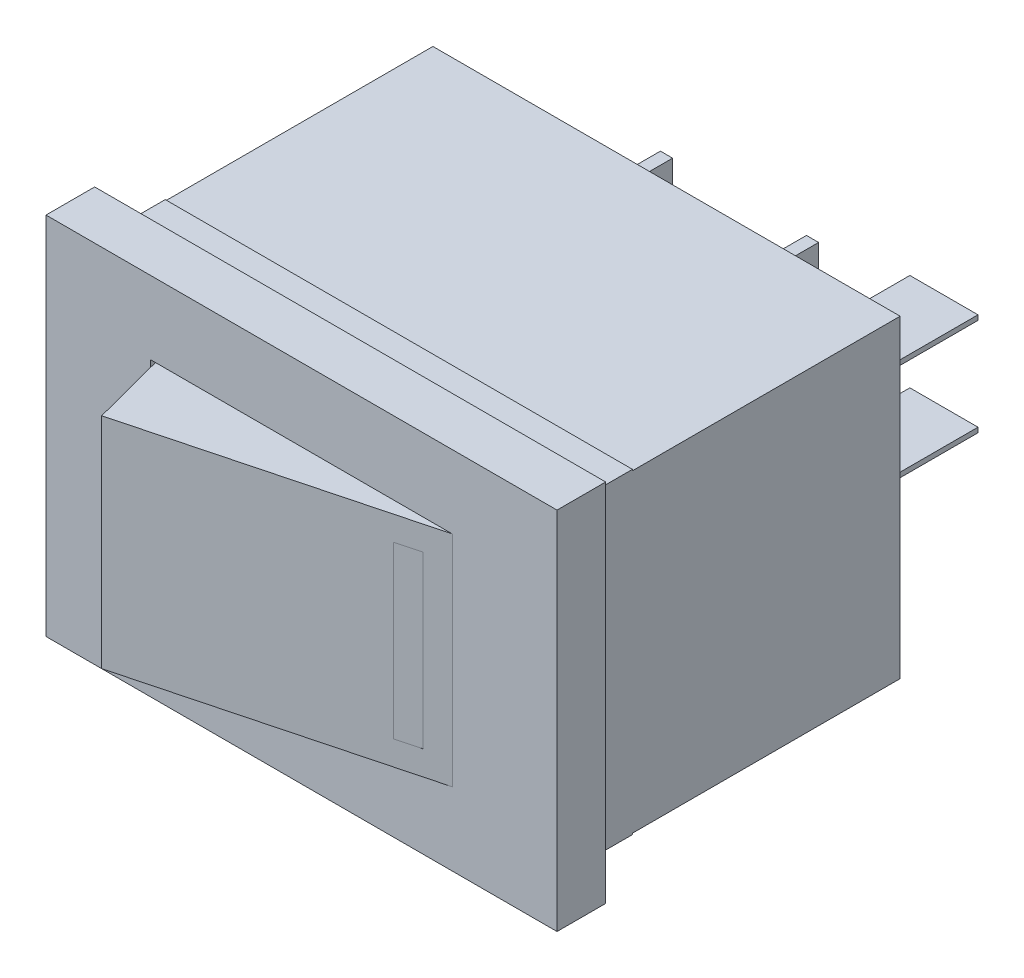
ISO-10303-21;
HEADER;
FILE_DESCRIPTION(('STEP AP214'),'2;1');
FILE_NAME('part.step','',(''),(''),'','','');
FILE_SCHEMA(('AUTOMOTIVE_DESIGN { 1 0 10303 214 1 1 1 1 }'));
ENDSEC;
DATA;
#1=APPLICATION_CONTEXT('core data for automotive mechanical design processes');
#2=APPLICATION_PROTOCOL_DEFINITION('international standard','automotive_design',2000,#1);
#3=PRODUCT_CONTEXT('',#1,'mechanical');
#4=PRODUCT('Part','Part','',(#3));
#5=PRODUCT_RELATED_PRODUCT_CATEGORY('part','',(#4));
#6=PRODUCT_DEFINITION_FORMATION('','',#4);
#7=PRODUCT_DEFINITION_CONTEXT('part definition',#1,'design');
#8=PRODUCT_DEFINITION('design','',#6,#7);
#9=PRODUCT_DEFINITION_SHAPE('','',#8);
#10=(LENGTH_UNIT() NAMED_UNIT(*) SI_UNIT(.MILLI.,.METRE.));
#11=(NAMED_UNIT(*) PLANE_ANGLE_UNIT() SI_UNIT($,.RADIAN.));
#12=(NAMED_UNIT(*) SI_UNIT($,.STERADIAN.) SOLID_ANGLE_UNIT());
#13=UNCERTAINTY_MEASURE_WITH_UNIT(LENGTH_MEASURE(1.E-05),#10,'distance_accuracy_value','');
#14=(GEOMETRIC_REPRESENTATION_CONTEXT(3) GLOBAL_UNCERTAINTY_ASSIGNED_CONTEXT((#13)) GLOBAL_UNIT_ASSIGNED_CONTEXT((#10,
#11,#12)) REPRESENTATION_CONTEXT('',''));
#15=CARTESIAN_POINT('',(0.,0.,0.));
#16=DIRECTION('',(0.,0.,1.));
#17=DIRECTION('',(1.,0.,0.));
#18=AXIS2_PLACEMENT_3D('',#15,#16,#17);
#19=CARTESIAN_POINT('',(-24.6930619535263,4.5,1.28990063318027));
#20=DIRECTION('',(0.,1.,0.));
#21=DIRECTION('',(0.,0.,1.));
#22=AXIS2_PLACEMENT_3D('',#19,#20,#21);
#23=PLANE('',#22);
#24=DIRECTION('',(0.254120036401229,0.,0.967172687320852));
#25=VECTOR('',#24,1.);
#26=CARTESIAN_POINT('',(5.03897727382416,4.5,-2.41881516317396));
#27=LINE('',#26,#25);
#28=CARTESIAN_POINT('',(5.03897727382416,4.5,-2.41881516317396));
#29=VERTEX_POINT('',#28);
#30=CARTESIAN_POINT('',(6.2,4.5,2.));
#31=VERTEX_POINT('',#30);
#32=EDGE_CURVE('E13',#29,#31,#27,.T.);
#33=ORIENTED_EDGE('',*,*,#32,.F.);
#34=DIRECTION('',(0.967172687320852,0.,-0.254120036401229));
#35=VECTOR('',#34,1.);
#36=CARTESIAN_POINT('',(-6.3736604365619,4.5,0.579801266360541));
#37=LINE('',#36,#35);
#38=CARTESIAN_POINT('',(-6.3736604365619,4.5,0.579801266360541));
#39=VERTEX_POINT('',#38);
#40=EDGE_CURVE('E71',#39,#29,#37,.T.);
#41=ORIENTED_EDGE('',*,*,#40,.F.);
#42=DIRECTION('',(-0.254120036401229,0.,-0.967172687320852));
#43=VECTOR('',#42,1.);
#44=CARTESIAN_POINT('',(-5.21263771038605,4.5,4.99861642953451));
#45=LINE('',#44,#43);
#46=CARTESIAN_POINT('',(-5.21263771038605,4.5,4.99861642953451));
#47=VERTEX_POINT('',#46);
#48=EDGE_CURVE('E172',#47,#39,#45,.T.);
#49=ORIENTED_EDGE('',*,*,#48,.F.);
#50=DIRECTION('',(-0.967172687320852,0.,0.254120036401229));
#51=VECTOR('',#50,1.);
#52=CARTESIAN_POINT('',(6.2,4.5,2.));
#53=LINE('',#52,#51);
#54=EDGE_CURVE('E178',#31,#47,#53,.T.);
#55=ORIENTED_EDGE('',*,*,#54,.F.);
#56=EDGE_LOOP('',(#33,#41,#49,#55));
#57=FACE_BOUND('',#56,.T.);
#58=ADVANCED_FACE('F46',(#57),#23,.T.);
#59=CARTESIAN_POINT('',(-6.3736604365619,0.,0.579801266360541));
#60=DIRECTION('',(0.254120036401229,0.,0.967172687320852));
#61=DIRECTION('',(0.967172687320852,0.,-0.254120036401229));
#62=AXIS2_PLACEMENT_3D('',#59,#60,#61);
#63=PLANE('',#62);
#64=ORIENTED_EDGE('',*,*,#40,.T.);
#65=DIRECTION('',(0.,1.,0.));
#66=VECTOR('',#65,1.);
#67=CARTESIAN_POINT('',(5.03897727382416,0.,-2.41881516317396));
#68=LINE('',#67,#66);
#69=CARTESIAN_POINT('',(5.03897727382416,-4.5,-2.41881516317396));
#70=VERTEX_POINT('',#69);
#71=EDGE_CURVE('E170',#70,#29,#68,.T.);
#72=ORIENTED_EDGE('',*,*,#71,.F.);
#73=DIRECTION('',(0.967172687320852,0.,-0.254120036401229));
#74=VECTOR('',#73,1.);
#75=CARTESIAN_POINT('',(-6.3736604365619,-4.5,0.579801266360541));
#76=LINE('',#75,#74);
#77=CARTESIAN_POINT('',(-6.3736604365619,-4.5,0.579801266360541));
#78=VERTEX_POINT('',#77);
#79=EDGE_CURVE('E147',#78,#70,#76,.T.);
#80=ORIENTED_EDGE('',*,*,#79,.F.);
#81=DIRECTION('',(0.,1.,0.));
#82=VECTOR('',#81,1.);
#83=CARTESIAN_POINT('',(-6.3736604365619,0.,0.579801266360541));
#84=LINE('',#83,#82);
#85=EDGE_CURVE('E173',#78,#39,#84,.T.);
#86=ORIENTED_EDGE('',*,*,#85,.T.);
#87=EDGE_LOOP('',(#64,#72,#80,#86));
#88=FACE_BOUND('',#87,.T.);
#89=ADVANCED_FACE('F197',(#88),#63,.F.);
#90=CARTESIAN_POINT('',(-5.21263771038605,0.,4.99861642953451));
#91=DIRECTION('',(0.967172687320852,0.,-0.254120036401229));
#92=DIRECTION('',(-0.254120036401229,0.,-0.967172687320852));
#93=AXIS2_PLACEMENT_3D('',#90,#91,#92);
#94=PLANE('',#93);
#95=ORIENTED_EDGE('',*,*,#48,.T.);
#96=ORIENTED_EDGE('',*,*,#85,.F.);
#97=DIRECTION('',(-0.254120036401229,0.,-0.967172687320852));
#98=VECTOR('',#97,1.);
#99=CARTESIAN_POINT('',(-5.21263771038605,-4.5,4.99861642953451));
#100=LINE('',#99,#98);
#101=CARTESIAN_POINT('',(-5.21263771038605,-4.5,4.99861642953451));
#102=VERTEX_POINT('',#101);
#103=EDGE_CURVE('E153',#102,#78,#100,.T.);
#104=ORIENTED_EDGE('',*,*,#103,.F.);
#105=DIRECTION('',(0.,1.,0.));
#106=VECTOR('',#105,1.);
#107=CARTESIAN_POINT('',(-5.21263771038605,0.,4.99861642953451));
#108=LINE('',#107,#106);
#109=EDGE_CURVE('E187',#102,#47,#108,.T.);
#110=ORIENTED_EDGE('',*,*,#109,.T.);
#111=EDGE_LOOP('',(#95,#96,#104,#110));
#112=FACE_BOUND('',#111,.T.);
#113=ADVANCED_FACE('F212',(#112),#94,.F.);
#114=CARTESIAN_POINT('',(6.2,0.,2.));
#115=DIRECTION('',(-0.254120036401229,0.,-0.967172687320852));
#116=DIRECTION('',(-0.967172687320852,0.,0.254120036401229));
#117=AXIS2_PLACEMENT_3D('',#114,#115,#116);
#118=PLANE('',#117);
#119=DIRECTION('',(0.967172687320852,0.,-0.254120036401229));
#120=VECTOR('',#119,1.);
#121=CARTESIAN_POINT('',(4.27703767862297,-3.5,2.50524922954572));
#122=LINE('',#121,#120);
#123=CARTESIAN_POINT('',(4.27703767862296,-3.5,2.50524922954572));
#124=VERTEX_POINT('',#123);
#125=CARTESIAN_POINT('',(5.24421036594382,-3.5,2.25112919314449));
#126=VERTEX_POINT('',#125);
#127=EDGE_CURVE('E141',#124,#126,#122,.T.);
#128=ORIENTED_EDGE('',*,*,#127,.F.);
#129=DIRECTION('',(0.,-1.,0.));
#130=VECTOR('',#129,1.);
#131=CARTESIAN_POINT('',(4.27703767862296,3.5,2.50524922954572));
#132=LINE('',#131,#130);
#133=CARTESIAN_POINT('',(4.27703767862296,3.5,2.50524922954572));
#134=VERTEX_POINT('',#133);
#135=EDGE_CURVE('E62',#134,#124,#132,.T.);
#136=ORIENTED_EDGE('',*,*,#135,.F.);
#137=DIRECTION('',(-0.967172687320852,0.,0.254120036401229));
#138=VECTOR('',#137,1.);
#139=CARTESIAN_POINT('',(4.27703767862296,3.5,2.50524922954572));
#140=LINE('',#139,#138);
#141=CARTESIAN_POINT('',(5.24421036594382,3.5,2.25112919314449));
#142=VERTEX_POINT('',#141);
#143=EDGE_CURVE('E132',#142,#134,#140,.T.);
#144=ORIENTED_EDGE('',*,*,#143,.F.);
#145=DIRECTION('',(0.,1.,0.));
#146=VECTOR('',#145,1.);
#147=CARTESIAN_POINT('',(5.24421036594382,3.5,2.25112919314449));
#148=LINE('',#147,#146);
#149=EDGE_CURVE('E135',#126,#142,#148,.T.);
#150=ORIENTED_EDGE('',*,*,#149,.F.);
#151=EDGE_LOOP('',(#128,#136,#144,#150));
#152=FACE_BOUND('',#151,.T.);
#153=ORIENTED_EDGE('',*,*,#54,.T.);
#154=ORIENTED_EDGE('',*,*,#109,.F.);
#155=DIRECTION('',(-0.967172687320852,0.,0.254120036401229));
#156=VECTOR('',#155,1.);
#157=CARTESIAN_POINT('',(6.2,-4.5,2.));
#158=LINE('',#157,#156);
#159=CARTESIAN_POINT('',(6.2,-4.5,2.));
#160=VERTEX_POINT('',#159);
#161=EDGE_CURVE('E159',#160,#102,#158,.T.);
#162=ORIENTED_EDGE('',*,*,#161,.F.);
#163=DIRECTION('',(0.,1.,0.));
#164=VECTOR('',#163,1.);
#165=CARTESIAN_POINT('',(6.2,0.,2.));
#166=LINE('',#165,#164);
#167=EDGE_CURVE('E54',#160,#31,#166,.T.);
#168=ORIENTED_EDGE('',*,*,#167,.T.);
#169=EDGE_LOOP('',(#153,#154,#162,#168));
#170=FACE_BOUND('',#169,.T.);
#171=ADVANCED_FACE('F209',(#152,#170),#118,.F.);
#172=CARTESIAN_POINT('',(5.03897727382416,0.,-2.41881516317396));
#173=DIRECTION('',(-0.967172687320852,0.,0.254120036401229));
#174=DIRECTION('',(0.254120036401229,0.,0.967172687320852));
#175=AXIS2_PLACEMENT_3D('',#172,#173,#174);
#176=PLANE('',#175);
#177=ORIENTED_EDGE('',*,*,#32,.T.);
#178=ORIENTED_EDGE('',*,*,#167,.F.);
#179=DIRECTION('',(0.254120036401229,0.,0.967172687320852));
#180=VECTOR('',#179,1.);
#181=CARTESIAN_POINT('',(5.03897727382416,-4.5,-2.41881516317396));
#182=LINE('',#181,#180);
#183=EDGE_CURVE('E156',#70,#160,#182,.T.);
#184=ORIENTED_EDGE('',*,*,#183,.F.);
#185=ORIENTED_EDGE('',*,*,#71,.T.);
#186=EDGE_LOOP('',(#177,#178,#184,#185));
#187=FACE_BOUND('',#186,.T.);
#188=ADVANCED_FACE('F205',(#187),#176,.F.);
#189=CARTESIAN_POINT('',(-24.6930619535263,-4.5,1.28990063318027));
#190=DIRECTION('',(0.,1.,0.));
#191=DIRECTION('',(0.,0.,1.));
#192=AXIS2_PLACEMENT_3D('',#189,#190,#191);
#193=PLANE('',#192);
#194=ORIENTED_EDGE('',*,*,#183,.T.);
#195=ORIENTED_EDGE('',*,*,#161,.T.);
#196=ORIENTED_EDGE('',*,*,#103,.T.);
#197=ORIENTED_EDGE('',*,*,#79,.T.);
#198=EDGE_LOOP('',(#194,#195,#196,#197));
#199=FACE_BOUND('',#198,.T.);
#200=ADVANCED_FACE('F211',(#199),#193,.F.);
#201=CARTESIAN_POINT('',(4.27678355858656,3.5,2.5042820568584));
#202=DIRECTION('',(-0.967172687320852,0.,0.254120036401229));
#203=DIRECTION('',(0.254120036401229,0.,0.967172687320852));
#204=AXIS2_PLACEMENT_3D('',#201,#202,#203);
#205=PLANE('',#204);
#206=ORIENTED_EDGE('',*,*,#135,.T.);
#207=DIRECTION('',(0.254120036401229,0.,0.967172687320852));
#208=VECTOR('',#207,1.);
#209=CARTESIAN_POINT('',(4.27678355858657,-3.5,2.5042820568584));
#210=LINE('',#209,#208);
#211=CARTESIAN_POINT('',(4.27678355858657,-3.5,2.5042820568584));
#212=VERTEX_POINT('',#211);
#213=EDGE_CURVE('E110',#212,#124,#210,.T.);
#214=ORIENTED_EDGE('',*,*,#213,.F.);
#215=DIRECTION('',(0.,-1.,0.));
#216=VECTOR('',#215,1.);
#217=CARTESIAN_POINT('',(4.27678355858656,3.5,2.5042820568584));
#218=LINE('',#217,#216);
#219=CARTESIAN_POINT('',(4.27678355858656,3.5,2.5042820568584));
#220=VERTEX_POINT('',#219);
#221=EDGE_CURVE('E114',#220,#212,#218,.T.);
#222=ORIENTED_EDGE('',*,*,#221,.F.);
#223=DIRECTION('',(0.254120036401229,0.,0.967172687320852));
#224=VECTOR('',#223,1.);
#225=CARTESIAN_POINT('',(4.27678355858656,3.5,2.5042820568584));
#226=LINE('',#225,#224);
#227=EDGE_CURVE('E145',#220,#134,#226,.T.);
#228=ORIENTED_EDGE('',*,*,#227,.T.);
#229=EDGE_LOOP('',(#206,#214,#222,#228));
#230=FACE_BOUND('',#229,.T.);
#231=ADVANCED_FACE('F112',(#230),#205,.F.);
#232=CARTESIAN_POINT('',(4.27678355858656,3.5,2.5042820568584));
#233=DIRECTION('',(0.,1.,0.));
#234=DIRECTION('',(0.,0.,1.));
#235=AXIS2_PLACEMENT_3D('',#232,#233,#234);
#236=PLANE('',#235);
#237=ORIENTED_EDGE('',*,*,#143,.T.);
#238=ORIENTED_EDGE('',*,*,#227,.F.);
#239=DIRECTION('',(-0.967172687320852,0.,0.254120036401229));
#240=VECTOR('',#239,1.);
#241=CARTESIAN_POINT('',(4.27678355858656,3.5,2.5042820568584));
#242=LINE('',#241,#240);
#243=CARTESIAN_POINT('',(5.24395624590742,3.5,2.25016202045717));
#244=VERTEX_POINT('',#243);
#245=EDGE_CURVE('E120',#244,#220,#242,.T.);
#246=ORIENTED_EDGE('',*,*,#245,.F.);
#247=DIRECTION('',(0.254120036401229,0.,0.967172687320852));
#248=VECTOR('',#247,1.);
#249=CARTESIAN_POINT('',(5.24395624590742,3.5,2.25016202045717));
#250=LINE('',#249,#248);
#251=EDGE_CURVE('E148',#244,#142,#250,.T.);
#252=ORIENTED_EDGE('',*,*,#251,.T.);
#253=EDGE_LOOP('',(#237,#238,#246,#252));
#254=FACE_BOUND('',#253,.T.);
#255=ADVANCED_FACE('F230',(#254),#236,.F.);
#256=CARTESIAN_POINT('',(5.24395624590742,3.5,2.25016202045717));
#257=DIRECTION('',(0.967172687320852,0.,-0.254120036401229));
#258=DIRECTION('',(-0.254120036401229,0.,-0.967172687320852));
#259=AXIS2_PLACEMENT_3D('',#256,#257,#258);
#260=PLANE('',#259);
#261=ORIENTED_EDGE('',*,*,#149,.T.);
#262=ORIENTED_EDGE('',*,*,#251,.F.);
#263=DIRECTION('',(0.,1.,0.));
#264=VECTOR('',#263,1.);
#265=CARTESIAN_POINT('',(5.24395624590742,3.5,2.25016202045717));
#266=LINE('',#265,#264);
#267=CARTESIAN_POINT('',(5.24395624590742,-3.5,2.25016202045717));
#268=VERTEX_POINT('',#267);
#269=EDGE_CURVE('E128',#268,#244,#266,.T.);
#270=ORIENTED_EDGE('',*,*,#269,.F.);
#271=DIRECTION('',(0.254120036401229,0.,0.967172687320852));
#272=VECTOR('',#271,1.);
#273=CARTESIAN_POINT('',(5.24395624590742,-3.5,2.25016202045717));
#274=LINE('',#273,#272);
#275=EDGE_CURVE('E119',#268,#126,#274,.T.);
#276=ORIENTED_EDGE('',*,*,#275,.T.);
#277=EDGE_LOOP('',(#261,#262,#270,#276));
#278=FACE_BOUND('',#277,.T.);
#279=ADVANCED_FACE('F272',(#278),#260,.F.);
#280=CARTESIAN_POINT('',(4.27678355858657,-3.5,2.5042820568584));
#281=DIRECTION('',(0.,-1.,0.));
#282=DIRECTION('',(0.,0.,-1.));
#283=AXIS2_PLACEMENT_3D('',#280,#281,#282);
#284=PLANE('',#283);
#285=ORIENTED_EDGE('',*,*,#127,.T.);
#286=ORIENTED_EDGE('',*,*,#275,.F.);
#287=DIRECTION('',(0.967172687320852,0.,-0.254120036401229));
#288=VECTOR('',#287,1.);
#289=CARTESIAN_POINT('',(4.27678355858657,-3.5,2.5042820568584));
#290=LINE('',#289,#288);
#291=EDGE_CURVE('E123',#212,#268,#290,.T.);
#292=ORIENTED_EDGE('',*,*,#291,.F.);
#293=ORIENTED_EDGE('',*,*,#213,.T.);
#294=EDGE_LOOP('',(#285,#286,#292,#293));
#295=FACE_BOUND('',#294,.T.);
#296=ADVANCED_FACE('F124',(#295),#284,.F.);
#297=CARTESIAN_POINT('',(4.27678355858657,-3.5,2.5042820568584));
#298=DIRECTION('',(0.254120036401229,0.,0.967172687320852));
#299=DIRECTION('',(0.967172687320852,0.,-0.254120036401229));
#300=AXIS2_PLACEMENT_3D('',#297,#298,#299);
#301=PLANE('',#300);
#302=ORIENTED_EDGE('',*,*,#221,.T.);
#303=ORIENTED_EDGE('',*,*,#291,.T.);
#304=ORIENTED_EDGE('',*,*,#269,.T.);
#305=ORIENTED_EDGE('',*,*,#245,.T.);
#306=EDGE_LOOP('',(#302,#303,#304,#305));
#307=FACE_BOUND('',#306,.T.);
#308=ADVANCED_FACE('F130',(#307),#301,.T.);
#309=CLOSED_SHELL('',(#58,#89,#113,#171,#188,#200,#231,#255,#279,#296,#308));
#310=MANIFOLD_SOLID_BREP('B2',#309);
#311=CARTESIAN_POINT('',(6.8,-1.9,-19.));
#312=DIRECTION('',(-1.,0.,0.));
#313=DIRECTION('',(0.,0.,1.));
#314=AXIS2_PLACEMENT_3D('',#311,#312,#313);
#315=PLANE('',#314);
#316=DIRECTION('',(0.,-1.,0.));
#317=VECTOR('',#316,1.);
#318=CARTESIAN_POINT('',(6.8,-1.9,-13.));
#319=LINE('',#318,#317);
#320=CARTESIAN_POINT('',(6.8,-1.9,-13.));
#321=VERTEX_POINT('',#320);
#322=CARTESIAN_POINT('',(6.8,-2.1,-13.));
#323=VERTEX_POINT('',#322);
#324=EDGE_CURVE('E381',#321,#323,#319,.T.);
#325=ORIENTED_EDGE('',*,*,#324,.T.);
#326=DIRECTION('',(0.,0.,1.));
#327=VECTOR('',#326,1.);
#328=CARTESIAN_POINT('',(6.8,-2.1,-19.));
#329=LINE('',#328,#327);
#330=CARTESIAN_POINT('',(6.8,-2.1,-19.));
#331=VERTEX_POINT('',#330);
#332=EDGE_CURVE('E44',#331,#323,#329,.T.);
#333=ORIENTED_EDGE('',*,*,#332,.F.);
#334=DIRECTION('',(0.,-1.,0.));
#335=VECTOR('',#334,1.);
#336=CARTESIAN_POINT('',(6.8,-1.9,-19.));
#337=LINE('',#336,#335);
#338=CARTESIAN_POINT('',(6.8,-1.9,-19.));
#339=VERTEX_POINT('',#338);
#340=EDGE_CURVE('E369',#339,#331,#337,.T.);
#341=ORIENTED_EDGE('',*,*,#340,.F.);
#342=DIRECTION('',(0.,0.,1.));
#343=VECTOR('',#342,1.);
#344=CARTESIAN_POINT('',(6.8,-1.9,-19.));
#345=LINE('',#344,#343);
#346=EDGE_CURVE('E377',#339,#321,#345,.T.);
#347=ORIENTED_EDGE('',*,*,#346,.T.);
#348=EDGE_LOOP('',(#325,#333,#341,#347));
#349=FACE_BOUND('',#348,.T.);
#350=ADVANCED_FACE('F318',(#349),#315,.F.);
#351=CARTESIAN_POINT('',(6.8,-2.1,-19.));
#352=DIRECTION('',(0.,1.,0.));
#353=DIRECTION('',(0.,0.,1.));
#354=AXIS2_PLACEMENT_3D('',#351,#352,#353);
#355=PLANE('',#354);
#356=DIRECTION('',(-1.,0.,0.));
#357=VECTOR('',#356,1.);
#358=CARTESIAN_POINT('',(6.8,-2.1,-13.));
#359=LINE('',#358,#357);
#360=CARTESIAN_POINT('',(4.,-2.1,-13.));
#361=VERTEX_POINT('',#360);
#362=EDGE_CURVE('E373',#323,#361,#359,.T.);
#363=ORIENTED_EDGE('',*,*,#362,.T.);
#364=DIRECTION('',(0.,0.,1.));
#365=VECTOR('',#364,1.);
#366=CARTESIAN_POINT('',(4.,-2.1,-19.));
#367=LINE('',#366,#365);
#368=CARTESIAN_POINT('',(4.,-2.1,-19.));
#369=VERTEX_POINT('',#368);
#370=EDGE_CURVE('E326',#369,#361,#367,.T.);
#371=ORIENTED_EDGE('',*,*,#370,.F.);
#372=DIRECTION('',(-1.,0.,0.));
#373=VECTOR('',#372,1.);
#374=CARTESIAN_POINT('',(6.8,-2.1,-19.));
#375=LINE('',#374,#373);
#376=EDGE_CURVE('E364',#331,#369,#375,.T.);
#377=ORIENTED_EDGE('',*,*,#376,.F.);
#378=ORIENTED_EDGE('',*,*,#332,.T.);
#379=EDGE_LOOP('',(#363,#371,#377,#378));
#380=FACE_BOUND('',#379,.T.);
#381=ADVANCED_FACE('F372',(#380),#355,.F.);
#382=CARTESIAN_POINT('',(4.,-1.9,-19.));
#383=DIRECTION('',(1.,0.,0.));
#384=DIRECTION('',(0.,0.,-1.));
#385=AXIS2_PLACEMENT_3D('',#382,#383,#384);
#386=PLANE('',#385);
#387=DIRECTION('',(0.,1.,0.));
#388=VECTOR('',#387,1.);
#389=CARTESIAN_POINT('',(4.,-1.9,-13.));
#390=LINE('',#389,#388);
#391=CARTESIAN_POINT('',(4.,-1.9,-13.));
#392=VERTEX_POINT('',#391);
#393=EDGE_CURVE('E351',#361,#392,#390,.T.);
#394=ORIENTED_EDGE('',*,*,#393,.T.);
#395=DIRECTION('',(0.,0.,1.));
#396=VECTOR('',#395,1.);
#397=CARTESIAN_POINT('',(4.,-1.9,-19.));
#398=LINE('',#397,#396);
#399=CARTESIAN_POINT('',(4.,-1.9,-19.));
#400=VERTEX_POINT('',#399);
#401=EDGE_CURVE('E374',#400,#392,#398,.T.);
#402=ORIENTED_EDGE('',*,*,#401,.F.);
#403=DIRECTION('',(0.,1.,0.));
#404=VECTOR('',#403,1.);
#405=CARTESIAN_POINT('',(4.,-1.9,-19.));
#406=LINE('',#405,#404);
#407=EDGE_CURVE('E367',#369,#400,#406,.T.);
#408=ORIENTED_EDGE('',*,*,#407,.F.);
#409=ORIENTED_EDGE('',*,*,#370,.T.);
#410=EDGE_LOOP('',(#394,#402,#408,#409));
#411=FACE_BOUND('',#410,.T.);
#412=ADVANCED_FACE('F375',(#411),#386,.F.);
#413=CARTESIAN_POINT('',(6.8,-1.9,-19.));
#414=DIRECTION('',(0.,-1.,0.));
#415=DIRECTION('',(0.,0.,-1.));
#416=AXIS2_PLACEMENT_3D('',#413,#414,#415);
#417=PLANE('',#416);
#418=DIRECTION('',(1.,0.,0.));
#419=VECTOR('',#418,1.);
#420=CARTESIAN_POINT('',(6.8,-1.9,-13.));
#421=LINE('',#420,#419);
#422=EDGE_CURVE('E357',#392,#321,#421,.T.);
#423=ORIENTED_EDGE('',*,*,#422,.T.);
#424=ORIENTED_EDGE('',*,*,#346,.F.);
#425=DIRECTION('',(1.,0.,0.));
#426=VECTOR('',#425,1.);
#427=CARTESIAN_POINT('',(6.8,-1.9,-19.));
#428=LINE('',#427,#426);
#429=EDGE_CURVE('E334',#400,#339,#428,.T.);
#430=ORIENTED_EDGE('',*,*,#429,.F.);
#431=ORIENTED_EDGE('',*,*,#401,.T.);
#432=EDGE_LOOP('',(#423,#424,#430,#431));
#433=FACE_BOUND('',#432,.T.);
#434=ADVANCED_FACE('F388',(#433),#417,.F.);
#435=CARTESIAN_POINT('',(6.8,-2.1,-19.));
#436=DIRECTION('',(0.,0.,-1.));
#437=DIRECTION('',(-1.,0.,0.));
#438=AXIS2_PLACEMENT_3D('',#435,#436,#437);
#439=PLANE('',#438);
#440=ORIENTED_EDGE('',*,*,#340,.T.);
#441=ORIENTED_EDGE('',*,*,#376,.T.);
#442=ORIENTED_EDGE('',*,*,#407,.T.);
#443=ORIENTED_EDGE('',*,*,#429,.T.);
#444=EDGE_LOOP('',(#440,#441,#442,#443));
#445=FACE_BOUND('',#444,.T.);
#446=ADVANCED_FACE('F365',(#445),#439,.T.);
#447=CARTESIAN_POINT('',(6.8,-2.1,-13.));
#448=DIRECTION('',(0.,0.,-1.));
#449=DIRECTION('',(-1.,0.,0.));
#450=AXIS2_PLACEMENT_3D('',#447,#448,#449);
#451=PLANE('',#450);
#452=ORIENTED_EDGE('',*,*,#324,.F.);
#453=ORIENTED_EDGE('',*,*,#422,.F.);
#454=ORIENTED_EDGE('',*,*,#393,.F.);
#455=ORIENTED_EDGE('',*,*,#362,.F.);
#456=EDGE_LOOP('',(#452,#453,#454,#455));
#457=FACE_BOUND('',#456,.T.);
#458=ADVANCED_FACE('F391',(#457),#451,.F.);
#459=CLOSED_SHELL('',(#350,#381,#412,#434,#446,#458));
#460=MANIFOLD_SOLID_BREP('B7',#459);
#461=CARTESIAN_POINT('',(6.8,2.1,-19.));
#462=DIRECTION('',(-1.,0.,0.));
#463=DIRECTION('',(0.,0.,1.));
#464=AXIS2_PLACEMENT_3D('',#461,#462,#463);
#465=PLANE('',#464);
#466=DIRECTION('',(0.,-1.,0.));
#467=VECTOR('',#466,1.);
#468=CARTESIAN_POINT('',(6.8,2.1,-13.));
#469=LINE('',#468,#467);
#470=CARTESIAN_POINT('',(6.8,2.1,-13.));
#471=VERTEX_POINT('',#470);
#472=CARTESIAN_POINT('',(6.8,1.9,-13.));
#473=VERTEX_POINT('',#472);
#474=EDGE_CURVE('E514',#471,#473,#469,.T.);
#475=ORIENTED_EDGE('',*,*,#474,.T.);
#476=DIRECTION('',(0.,0.,1.));
#477=VECTOR('',#476,1.);
#478=CARTESIAN_POINT('',(6.8,1.9,-19.));
#479=LINE('',#478,#477);
#480=CARTESIAN_POINT('',(6.8,1.9,-19.));
#481=VERTEX_POINT('',#480);
#482=EDGE_CURVE('E316',#481,#473,#479,.T.);
#483=ORIENTED_EDGE('',*,*,#482,.F.);
#484=DIRECTION('',(0.,-1.,0.));
#485=VECTOR('',#484,1.);
#486=CARTESIAN_POINT('',(6.8,2.1,-19.));
#487=LINE('',#486,#485);
#488=CARTESIAN_POINT('',(6.8,2.1,-19.));
#489=VERTEX_POINT('',#488);
#490=EDGE_CURVE('E502',#489,#481,#487,.T.);
#491=ORIENTED_EDGE('',*,*,#490,.F.);
#492=DIRECTION('',(0.,0.,1.));
#493=VECTOR('',#492,1.);
#494=CARTESIAN_POINT('',(6.8,2.1,-19.));
#495=LINE('',#494,#493);
#496=EDGE_CURVE('E510',#489,#471,#495,.T.);
#497=ORIENTED_EDGE('',*,*,#496,.T.);
#498=EDGE_LOOP('',(#475,#483,#491,#497));
#499=FACE_BOUND('',#498,.T.);
#500=ADVANCED_FACE('F451',(#499),#465,.F.);
#501=CARTESIAN_POINT('',(6.8,1.9,-19.));
#502=DIRECTION('',(0.,1.,0.));
#503=DIRECTION('',(0.,0.,1.));
#504=AXIS2_PLACEMENT_3D('',#501,#502,#503);
#505=PLANE('',#504);
#506=DIRECTION('',(-1.,0.,0.));
#507=VECTOR('',#506,1.);
#508=CARTESIAN_POINT('',(6.8,1.9,-13.));
#509=LINE('',#508,#507);
#510=CARTESIAN_POINT('',(4.,1.9,-13.));
#511=VERTEX_POINT('',#510);
#512=EDGE_CURVE('E506',#473,#511,#509,.T.);
#513=ORIENTED_EDGE('',*,*,#512,.T.);
#514=DIRECTION('',(0.,0.,1.));
#515=VECTOR('',#514,1.);
#516=CARTESIAN_POINT('',(4.,1.9,-19.));
#517=LINE('',#516,#515);
#518=CARTESIAN_POINT('',(4.,1.9,-19.));
#519=VERTEX_POINT('',#518);
#520=EDGE_CURVE('E459',#519,#511,#517,.T.);
#521=ORIENTED_EDGE('',*,*,#520,.F.);
#522=DIRECTION('',(-1.,0.,0.));
#523=VECTOR('',#522,1.);
#524=CARTESIAN_POINT('',(6.8,1.9,-19.));
#525=LINE('',#524,#523);
#526=EDGE_CURVE('E497',#481,#519,#525,.T.);
#527=ORIENTED_EDGE('',*,*,#526,.F.);
#528=ORIENTED_EDGE('',*,*,#482,.T.);
#529=EDGE_LOOP('',(#513,#521,#527,#528));
#530=FACE_BOUND('',#529,.T.);
#531=ADVANCED_FACE('F505',(#530),#505,.F.);
#532=CARTESIAN_POINT('',(4.,2.1,-19.));
#533=DIRECTION('',(1.,0.,0.));
#534=DIRECTION('',(0.,0.,-1.));
#535=AXIS2_PLACEMENT_3D('',#532,#533,#534);
#536=PLANE('',#535);
#537=DIRECTION('',(0.,1.,0.));
#538=VECTOR('',#537,1.);
#539=CARTESIAN_POINT('',(4.,2.1,-13.));
#540=LINE('',#539,#538);
#541=CARTESIAN_POINT('',(4.,2.1,-13.));
#542=VERTEX_POINT('',#541);
#543=EDGE_CURVE('E484',#511,#542,#540,.T.);
#544=ORIENTED_EDGE('',*,*,#543,.T.);
#545=DIRECTION('',(0.,0.,1.));
#546=VECTOR('',#545,1.);
#547=CARTESIAN_POINT('',(4.,2.1,-19.));
#548=LINE('',#547,#546);
#549=CARTESIAN_POINT('',(4.,2.1,-19.));
#550=VERTEX_POINT('',#549);
#551=EDGE_CURVE('E507',#550,#542,#548,.T.);
#552=ORIENTED_EDGE('',*,*,#551,.F.);
#553=DIRECTION('',(0.,1.,0.));
#554=VECTOR('',#553,1.);
#555=CARTESIAN_POINT('',(4.,2.1,-19.));
#556=LINE('',#555,#554);
#557=EDGE_CURVE('E500',#519,#550,#556,.T.);
#558=ORIENTED_EDGE('',*,*,#557,.F.);
#559=ORIENTED_EDGE('',*,*,#520,.T.);
#560=EDGE_LOOP('',(#544,#552,#558,#559));
#561=FACE_BOUND('',#560,.T.);
#562=ADVANCED_FACE('F508',(#561),#536,.F.);
#563=CARTESIAN_POINT('',(6.8,2.1,-19.));
#564=DIRECTION('',(0.,-1.,0.));
#565=DIRECTION('',(0.,0.,-1.));
#566=AXIS2_PLACEMENT_3D('',#563,#564,#565);
#567=PLANE('',#566);
#568=DIRECTION('',(1.,0.,0.));
#569=VECTOR('',#568,1.);
#570=CARTESIAN_POINT('',(6.8,2.1,-13.));
#571=LINE('',#570,#569);
#572=EDGE_CURVE('E490',#542,#471,#571,.T.);
#573=ORIENTED_EDGE('',*,*,#572,.T.);
#574=ORIENTED_EDGE('',*,*,#496,.F.);
#575=DIRECTION('',(1.,0.,0.));
#576=VECTOR('',#575,1.);
#577=CARTESIAN_POINT('',(6.8,2.1,-19.));
#578=LINE('',#577,#576);
#579=EDGE_CURVE('E467',#550,#489,#578,.T.);
#580=ORIENTED_EDGE('',*,*,#579,.F.);
#581=ORIENTED_EDGE('',*,*,#551,.T.);
#582=EDGE_LOOP('',(#573,#574,#580,#581));
#583=FACE_BOUND('',#582,.T.);
#584=ADVANCED_FACE('F521',(#583),#567,.F.);
#585=CARTESIAN_POINT('',(6.8,1.9,-19.));
#586=DIRECTION('',(0.,0.,-1.));
#587=DIRECTION('',(-1.,0.,0.));
#588=AXIS2_PLACEMENT_3D('',#585,#586,#587);
#589=PLANE('',#588);
#590=ORIENTED_EDGE('',*,*,#490,.T.);
#591=ORIENTED_EDGE('',*,*,#526,.T.);
#592=ORIENTED_EDGE('',*,*,#557,.T.);
#593=ORIENTED_EDGE('',*,*,#579,.T.);
#594=EDGE_LOOP('',(#590,#591,#592,#593));
#595=FACE_BOUND('',#594,.T.);
#596=ADVANCED_FACE('F498',(#595),#589,.T.);
#597=CARTESIAN_POINT('',(6.8,1.9,-13.));
#598=DIRECTION('',(0.,0.,-1.));
#599=DIRECTION('',(-1.,0.,0.));
#600=AXIS2_PLACEMENT_3D('',#597,#598,#599);
#601=PLANE('',#600);
#602=ORIENTED_EDGE('',*,*,#474,.F.);
#603=ORIENTED_EDGE('',*,*,#572,.F.);
#604=ORIENTED_EDGE('',*,*,#543,.F.);
#605=ORIENTED_EDGE('',*,*,#512,.F.);
#606=EDGE_LOOP('',(#602,#603,#604,#605));
#607=FACE_BOUND('',#606,.T.);
#608=ADVANCED_FACE('F524',(#607),#601,.F.);
#609=CLOSED_SHELL('',(#500,#531,#562,#584,#596,#608));
#610=MANIFOLD_SOLID_BREP('B38',#609);
#611=CARTESIAN_POINT('',(-5.75,1.4,-19.));
#612=DIRECTION('',(-1.,0.,0.));
#613=DIRECTION('',(0.,0.,1.));
#614=AXIS2_PLACEMENT_3D('',#611,#612,#613);
#615=PLANE('',#614);
#616=DIRECTION('',(0.,-1.,0.));
#617=VECTOR('',#616,1.);
#618=CARTESIAN_POINT('',(-5.75,1.4,-13.));
#619=LINE('',#618,#617);
#620=CARTESIAN_POINT('',(-5.75,1.4,-13.));
#621=VERTEX_POINT('',#620);
#622=CARTESIAN_POINT('',(-5.75,-1.4,-13.));
#623=VERTEX_POINT('',#622);
#624=EDGE_CURVE('E647',#621,#623,#619,.T.);
#625=ORIENTED_EDGE('',*,*,#624,.T.);
#626=DIRECTION('',(0.,0.,1.));
#627=VECTOR('',#626,1.);
#628=CARTESIAN_POINT('',(-5.75,-1.4,-19.));
#629=LINE('',#628,#627);
#630=CARTESIAN_POINT('',(-5.75,-1.4,-19.));
#631=VERTEX_POINT('',#630);
#632=EDGE_CURVE('E449',#631,#623,#629,.T.);
#633=ORIENTED_EDGE('',*,*,#632,.F.);
#634=DIRECTION('',(0.,-1.,0.));
#635=VECTOR('',#634,1.);
#636=CARTESIAN_POINT('',(-5.75,1.4,-19.));
#637=LINE('',#636,#635);
#638=CARTESIAN_POINT('',(-5.75,1.4,-19.));
#639=VERTEX_POINT('',#638);
#640=EDGE_CURVE('E635',#639,#631,#637,.T.);
#641=ORIENTED_EDGE('',*,*,#640,.F.);
#642=DIRECTION('',(0.,0.,1.));
#643=VECTOR('',#642,1.);
#644=CARTESIAN_POINT('',(-5.75,1.4,-19.));
#645=LINE('',#644,#643);
#646=EDGE_CURVE('E643',#639,#621,#645,.T.);
#647=ORIENTED_EDGE('',*,*,#646,.T.);
#648=EDGE_LOOP('',(#625,#633,#641,#647));
#649=FACE_BOUND('',#648,.T.);
#650=ADVANCED_FACE('F584',(#649),#615,.F.);
#651=CARTESIAN_POINT('',(-5.75,-1.4,-19.));
#652=DIRECTION('',(0.,1.,0.));
#653=DIRECTION('',(0.,0.,1.));
#654=AXIS2_PLACEMENT_3D('',#651,#652,#653);
#655=PLANE('',#654);
#656=DIRECTION('',(-1.,0.,0.));
#657=VECTOR('',#656,1.);
#658=CARTESIAN_POINT('',(-5.75,-1.4,-13.));
#659=LINE('',#658,#657);
#660=CARTESIAN_POINT('',(-6.25,-1.4,-13.));
#661=VERTEX_POINT('',#660);
#662=EDGE_CURVE('E639',#623,#661,#659,.T.);
#663=ORIENTED_EDGE('',*,*,#662,.T.);
#664=DIRECTION('',(0.,0.,1.));
#665=VECTOR('',#664,1.);
#666=CARTESIAN_POINT('',(-6.25,-1.4,-19.));
#667=LINE('',#666,#665);
#668=CARTESIAN_POINT('',(-6.25,-1.4,-19.));
#669=VERTEX_POINT('',#668);
#670=EDGE_CURVE('E592',#669,#661,#667,.T.);
#671=ORIENTED_EDGE('',*,*,#670,.F.);
#672=DIRECTION('',(-1.,0.,0.));
#673=VECTOR('',#672,1.);
#674=CARTESIAN_POINT('',(-5.75,-1.4,-19.));
#675=LINE('',#674,#673);
#676=EDGE_CURVE('E630',#631,#669,#675,.T.);
#677=ORIENTED_EDGE('',*,*,#676,.F.);
#678=ORIENTED_EDGE('',*,*,#632,.T.);
#679=EDGE_LOOP('',(#663,#671,#677,#678));
#680=FACE_BOUND('',#679,.T.);
#681=ADVANCED_FACE('F638',(#680),#655,.F.);
#682=CARTESIAN_POINT('',(-6.25,1.4,-19.));
#683=DIRECTION('',(1.,0.,0.));
#684=DIRECTION('',(0.,0.,-1.));
#685=AXIS2_PLACEMENT_3D('',#682,#683,#684);
#686=PLANE('',#685);
#687=DIRECTION('',(0.,1.,0.));
#688=VECTOR('',#687,1.);
#689=CARTESIAN_POINT('',(-6.25,1.4,-13.));
#690=LINE('',#689,#688);
#691=CARTESIAN_POINT('',(-6.25,1.4,-13.));
#692=VERTEX_POINT('',#691);
#693=EDGE_CURVE('E617',#661,#692,#690,.T.);
#694=ORIENTED_EDGE('',*,*,#693,.T.);
#695=DIRECTION('',(0.,0.,1.));
#696=VECTOR('',#695,1.);
#697=CARTESIAN_POINT('',(-6.25,1.4,-19.));
#698=LINE('',#697,#696);
#699=CARTESIAN_POINT('',(-6.25,1.4,-19.));
#700=VERTEX_POINT('',#699);
#701=EDGE_CURVE('E640',#700,#692,#698,.T.);
#702=ORIENTED_EDGE('',*,*,#701,.F.);
#703=DIRECTION('',(0.,1.,0.));
#704=VECTOR('',#703,1.);
#705=CARTESIAN_POINT('',(-6.25,1.4,-19.));
#706=LINE('',#705,#704);
#707=EDGE_CURVE('E633',#669,#700,#706,.T.);
#708=ORIENTED_EDGE('',*,*,#707,.F.);
#709=ORIENTED_EDGE('',*,*,#670,.T.);
#710=EDGE_LOOP('',(#694,#702,#708,#709));
#711=FACE_BOUND('',#710,.T.);
#712=ADVANCED_FACE('F641',(#711),#686,.F.);
#713=CARTESIAN_POINT('',(-5.75,1.4,-19.));
#714=DIRECTION('',(0.,-1.,0.));
#715=DIRECTION('',(0.,0.,-1.));
#716=AXIS2_PLACEMENT_3D('',#713,#714,#715);
#717=PLANE('',#716);
#718=DIRECTION('',(1.,0.,0.));
#719=VECTOR('',#718,1.);
#720=CARTESIAN_POINT('',(-5.75,1.4,-13.));
#721=LINE('',#720,#719);
#722=EDGE_CURVE('E623',#692,#621,#721,.T.);
#723=ORIENTED_EDGE('',*,*,#722,.T.);
#724=ORIENTED_EDGE('',*,*,#646,.F.);
#725=DIRECTION('',(1.,0.,0.));
#726=VECTOR('',#725,1.);
#727=CARTESIAN_POINT('',(-5.75,1.4,-19.));
#728=LINE('',#727,#726);
#729=EDGE_CURVE('E600',#700,#639,#728,.T.);
#730=ORIENTED_EDGE('',*,*,#729,.F.);
#731=ORIENTED_EDGE('',*,*,#701,.T.);
#732=EDGE_LOOP('',(#723,#724,#730,#731));
#733=FACE_BOUND('',#732,.T.);
#734=ADVANCED_FACE('F654',(#733),#717,.F.);
#735=CARTESIAN_POINT('',(-5.75,-1.4,-19.));
#736=DIRECTION('',(0.,0.,-1.));
#737=DIRECTION('',(-1.,0.,0.));
#738=AXIS2_PLACEMENT_3D('',#735,#736,#737);
#739=PLANE('',#738);
#740=ORIENTED_EDGE('',*,*,#640,.T.);
#741=ORIENTED_EDGE('',*,*,#676,.T.);
#742=ORIENTED_EDGE('',*,*,#707,.T.);
#743=ORIENTED_EDGE('',*,*,#729,.T.);
#744=EDGE_LOOP('',(#740,#741,#742,#743));
#745=FACE_BOUND('',#744,.T.);
#746=ADVANCED_FACE('F631',(#745),#739,.T.);
#747=CARTESIAN_POINT('',(-5.75,-1.4,-13.));
#748=DIRECTION('',(0.,0.,-1.));
#749=DIRECTION('',(-1.,0.,0.));
#750=AXIS2_PLACEMENT_3D('',#747,#748,#749);
#751=PLANE('',#750);
#752=ORIENTED_EDGE('',*,*,#624,.F.);
#753=ORIENTED_EDGE('',*,*,#722,.F.);
#754=ORIENTED_EDGE('',*,*,#693,.F.);
#755=ORIENTED_EDGE('',*,*,#662,.F.);
#756=EDGE_LOOP('',(#752,#753,#754,#755));
#757=FACE_BOUND('',#756,.T.);
#758=ADVANCED_FACE('F657',(#757),#751,.F.);
#759=CLOSED_SHELL('',(#650,#681,#712,#734,#746,#758));
#760=MANIFOLD_SOLID_BREP('B310',#759);
#761=CARTESIAN_POINT('',(0.25,1.4,-19.));
#762=DIRECTION('',(-1.,0.,0.));
#763=DIRECTION('',(0.,0.,1.));
#764=AXIS2_PLACEMENT_3D('',#761,#762,#763);
#765=PLANE('',#764);
#766=DIRECTION('',(0.,-1.,0.));
#767=VECTOR('',#766,1.);
#768=CARTESIAN_POINT('',(0.25,1.4,-13.));
#769=LINE('',#768,#767);
#770=CARTESIAN_POINT('',(0.25,1.4,-13.));
#771=VERTEX_POINT('',#770);
#772=CARTESIAN_POINT('',(0.25,-1.4,-13.));
#773=VERTEX_POINT('',#772);
#774=EDGE_CURVE('E779',#771,#773,#769,.T.);
#775=ORIENTED_EDGE('',*,*,#774,.T.);
#776=DIRECTION('',(0.,0.,1.));
#777=VECTOR('',#776,1.);
#778=CARTESIAN_POINT('',(0.25,-1.4,-19.));
#779=LINE('',#778,#777);
#780=CARTESIAN_POINT('',(0.25,-1.4,-19.));
#781=VERTEX_POINT('',#780);
#782=EDGE_CURVE('E582',#781,#773,#779,.T.);
#783=ORIENTED_EDGE('',*,*,#782,.F.);
#784=DIRECTION('',(0.,-1.,0.));
#785=VECTOR('',#784,1.);
#786=CARTESIAN_POINT('',(0.25,1.4,-19.));
#787=LINE('',#786,#785);
#788=CARTESIAN_POINT('',(0.25,1.4,-19.));
#789=VERTEX_POINT('',#788);
#790=EDGE_CURVE('E767',#789,#781,#787,.T.);
#791=ORIENTED_EDGE('',*,*,#790,.F.);
#792=DIRECTION('',(0.,0.,1.));
#793=VECTOR('',#792,1.);
#794=CARTESIAN_POINT('',(0.25,1.4,-19.));
#795=LINE('',#794,#793);
#796=EDGE_CURVE('E775',#789,#771,#795,.T.);
#797=ORIENTED_EDGE('',*,*,#796,.T.);
#798=EDGE_LOOP('',(#775,#783,#791,#797));
#799=FACE_BOUND('',#798,.T.);
#800=ADVANCED_FACE('F716',(#799),#765,.F.);
#801=CARTESIAN_POINT('',(0.25,-1.4,-19.));
#802=DIRECTION('',(0.,1.,0.));
#803=DIRECTION('',(0.,0.,1.));
#804=AXIS2_PLACEMENT_3D('',#801,#802,#803);
#805=PLANE('',#804);
#806=DIRECTION('',(-1.,0.,0.));
#807=VECTOR('',#806,1.);
#808=CARTESIAN_POINT('',(0.25,-1.4,-13.));
#809=LINE('',#808,#807);
#810=CARTESIAN_POINT('',(-0.25,-1.4,-13.));
#811=VERTEX_POINT('',#810);
#812=EDGE_CURVE('E771',#773,#811,#809,.T.);
#813=ORIENTED_EDGE('',*,*,#812,.T.);
#814=DIRECTION('',(0.,0.,1.));
#815=VECTOR('',#814,1.);
#816=CARTESIAN_POINT('',(-0.25,-1.4,-19.));
#817=LINE('',#816,#815);
#818=CARTESIAN_POINT('',(-0.25,-1.4,-19.));
#819=VERTEX_POINT('',#818);
#820=EDGE_CURVE('E724',#819,#811,#817,.T.);
#821=ORIENTED_EDGE('',*,*,#820,.F.);
#822=DIRECTION('',(-1.,0.,0.));
#823=VECTOR('',#822,1.);
#824=CARTESIAN_POINT('',(0.25,-1.4,-19.));
#825=LINE('',#824,#823);
#826=EDGE_CURVE('E762',#781,#819,#825,.T.);
#827=ORIENTED_EDGE('',*,*,#826,.F.);
#828=ORIENTED_EDGE('',*,*,#782,.T.);
#829=EDGE_LOOP('',(#813,#821,#827,#828));
#830=FACE_BOUND('',#829,.T.);
#831=ADVANCED_FACE('F770',(#830),#805,.F.);
#832=CARTESIAN_POINT('',(-0.25,1.4,-19.));
#833=DIRECTION('',(1.,0.,0.));
#834=DIRECTION('',(0.,0.,-1.));
#835=AXIS2_PLACEMENT_3D('',#832,#833,#834);
#836=PLANE('',#835);
#837=DIRECTION('',(0.,1.,0.));
#838=VECTOR('',#837,1.);
#839=CARTESIAN_POINT('',(-0.25,1.4,-13.));
#840=LINE('',#839,#838);
#841=CARTESIAN_POINT('',(-0.25,1.4,-13.));
#842=VERTEX_POINT('',#841);
#843=EDGE_CURVE('E749',#811,#842,#840,.T.);
#844=ORIENTED_EDGE('',*,*,#843,.T.);
#845=DIRECTION('',(0.,0.,1.));
#846=VECTOR('',#845,1.);
#847=CARTESIAN_POINT('',(-0.25,1.4,-19.));
#848=LINE('',#847,#846);
#849=CARTESIAN_POINT('',(-0.25,1.4,-19.));
#850=VERTEX_POINT('',#849);
#851=EDGE_CURVE('E772',#850,#842,#848,.T.);
#852=ORIENTED_EDGE('',*,*,#851,.F.);
#853=DIRECTION('',(0.,1.,0.));
#854=VECTOR('',#853,1.);
#855=CARTESIAN_POINT('',(-0.25,1.4,-19.));
#856=LINE('',#855,#854);
#857=EDGE_CURVE('E765',#819,#850,#856,.T.);
#858=ORIENTED_EDGE('',*,*,#857,.F.);
#859=ORIENTED_EDGE('',*,*,#820,.T.);
#860=EDGE_LOOP('',(#844,#852,#858,#859));
#861=FACE_BOUND('',#860,.T.);
#862=ADVANCED_FACE('F773',(#861),#836,.F.);
#863=CARTESIAN_POINT('',(0.25,1.4,-19.));
#864=DIRECTION('',(0.,-1.,0.));
#865=DIRECTION('',(0.,0.,-1.));
#866=AXIS2_PLACEMENT_3D('',#863,#864,#865);
#867=PLANE('',#866);
#868=DIRECTION('',(1.,0.,0.));
#869=VECTOR('',#868,1.);
#870=CARTESIAN_POINT('',(0.25,1.4,-13.));
#871=LINE('',#870,#869);
#872=EDGE_CURVE('E755',#842,#771,#871,.T.);
#873=ORIENTED_EDGE('',*,*,#872,.T.);
#874=ORIENTED_EDGE('',*,*,#796,.F.);
#875=DIRECTION('',(1.,0.,0.));
#876=VECTOR('',#875,1.);
#877=CARTESIAN_POINT('',(0.25,1.4,-19.));
#878=LINE('',#877,#876);
#879=EDGE_CURVE('E732',#850,#789,#878,.T.);
#880=ORIENTED_EDGE('',*,*,#879,.F.);
#881=ORIENTED_EDGE('',*,*,#851,.T.);
#882=EDGE_LOOP('',(#873,#874,#880,#881));
#883=FACE_BOUND('',#882,.T.);
#884=ADVANCED_FACE('F786',(#883),#867,.F.);
#885=CARTESIAN_POINT('',(0.25,-1.4,-19.));
#886=DIRECTION('',(0.,0.,-1.));
#887=DIRECTION('',(-1.,0.,0.));
#888=AXIS2_PLACEMENT_3D('',#885,#886,#887);
#889=PLANE('',#888);
#890=ORIENTED_EDGE('',*,*,#790,.T.);
#891=ORIENTED_EDGE('',*,*,#826,.T.);
#892=ORIENTED_EDGE('',*,*,#857,.T.);
#893=ORIENTED_EDGE('',*,*,#879,.T.);
#894=EDGE_LOOP('',(#890,#891,#892,#893));
#895=FACE_BOUND('',#894,.T.);
#896=ADVANCED_FACE('F763',(#895),#889,.T.);
#897=CARTESIAN_POINT('',(0.25,-1.4,-13.));
#898=DIRECTION('',(0.,0.,-1.));
#899=DIRECTION('',(-1.,0.,0.));
#900=AXIS2_PLACEMENT_3D('',#897,#898,#899);
#901=PLANE('',#900);
#902=ORIENTED_EDGE('',*,*,#774,.F.);
#903=ORIENTED_EDGE('',*,*,#872,.F.);
#904=ORIENTED_EDGE('',*,*,#843,.F.);
#905=ORIENTED_EDGE('',*,*,#812,.F.);
#906=EDGE_LOOP('',(#902,#903,#904,#905));
#907=FACE_BOUND('',#906,.T.);
#908=ADVANCED_FACE('F789',(#907),#901,.F.);
#909=CLOSED_SHELL('',(#800,#831,#862,#884,#896,#908));
#910=MANIFOLD_SOLID_BREP('B443',#909);
#911=CARTESIAN_POINT('',(-10.5,-7.5,0.));
#912=DIRECTION('',(0.,0.,1.));
#913=DIRECTION('',(1.,0.,0.));
#914=AXIS2_PLACEMENT_3D('',#911,#912,#913);
#915=PLANE('',#914);
#916=DIRECTION('',(0.,-1.,0.));
#917=VECTOR('',#916,1.);
#918=CARTESIAN_POINT('',(-10.5,7.5,0.));
#919=LINE('',#918,#917);
#920=CARTESIAN_POINT('',(-10.5,7.5,0.));
#921=VERTEX_POINT('',#920);
#922=CARTESIAN_POINT('',(-10.5,-7.5,0.));
#923=VERTEX_POINT('',#922);
#924=EDGE_CURVE('E1052',#921,#923,#919,.T.);
#925=ORIENTED_EDGE('',*,*,#924,.F.);
#926=DIRECTION('',(-1.,0.,0.));
#927=VECTOR('',#926,1.);
#928=CARTESIAN_POINT('',(-10.5,7.5,0.));
#929=LINE('',#928,#927);
#930=CARTESIAN_POINT('',(10.5,7.5,0.));
#931=VERTEX_POINT('',#930);
#932=EDGE_CURVE('E1057',#931,#921,#929,.T.);
#933=ORIENTED_EDGE('',*,*,#932,.F.);
#934=DIRECTION('',(0.,1.,0.));
#935=VECTOR('',#934,1.);
#936=CARTESIAN_POINT('',(10.5,7.5,0.));
#937=LINE('',#936,#935);
#938=CARTESIAN_POINT('',(10.5,-7.5,0.));
#939=VERTEX_POINT('',#938);
#940=EDGE_CURVE('E1068',#939,#931,#937,.T.);
#941=ORIENTED_EDGE('',*,*,#940,.F.);
#942=DIRECTION('',(1.,0.,0.));
#943=VECTOR('',#942,1.);
#944=CARTESIAN_POINT('',(-10.5,-7.5,0.));
#945=LINE('',#944,#943);
#946=EDGE_CURVE('E1066',#923,#939,#945,.T.);
#947=ORIENTED_EDGE('',*,*,#946,.F.);
#948=EDGE_LOOP('',(#925,#933,#941,#947));
#949=FACE_BOUND('',#948,.T.);
#950=DIRECTION('',(0.,-1.,0.));
#951=VECTOR('',#950,1.);
#952=CARTESIAN_POINT('',(9.6,6.45,0.));
#953=LINE('',#952,#951);
#954=CARTESIAN_POINT('',(9.6,6.5,0.));
#955=VERTEX_POINT('',#954);
#956=CARTESIAN_POINT('',(9.6,-6.5,0.));
#957=VERTEX_POINT('',#956);
#958=EDGE_CURVE('E855',#955,#957,#953,.T.);
#959=ORIENTED_EDGE('',*,*,#958,.F.);
#960=DIRECTION('',(1.,0.,0.));
#961=VECTOR('',#960,1.);
#962=CARTESIAN_POINT('',(9.6,6.5,0.));
#963=LINE('',#962,#961);
#964=CARTESIAN_POINT('',(-9.6,6.5,0.));
#965=VERTEX_POINT('',#964);
#966=EDGE_CURVE('E983',#965,#955,#963,.T.);
#967=ORIENTED_EDGE('',*,*,#966,.F.);
#968=DIRECTION('',(0.,1.,0.));
#969=VECTOR('',#968,1.);
#970=CARTESIAN_POINT('',(-9.6,6.45,0.));
#971=LINE('',#970,#969);
#972=CARTESIAN_POINT('',(-9.6,-6.5,0.));
#973=VERTEX_POINT('',#972);
#974=EDGE_CURVE('E863',#973,#965,#971,.T.);
#975=ORIENTED_EDGE('',*,*,#974,.F.);
#976=DIRECTION('',(-1.,0.,0.));
#977=VECTOR('',#976,1.);
#978=CARTESIAN_POINT('',(-9.6,-6.5,0.));
#979=LINE('',#978,#977);
#980=EDGE_CURVE('E988',#957,#973,#979,.T.);
#981=ORIENTED_EDGE('',*,*,#980,.F.);
#982=EDGE_LOOP('',(#959,#967,#975,#981));
#983=FACE_BOUND('',#982,.T.);
#984=ADVANCED_FACE('F840',(#949,#983),#915,.F.);
#985=CARTESIAN_POINT('',(9.6,6.45,-13.));
#986=DIRECTION('',(0.,-1.,0.));
#987=DIRECTION('',(0.,0.,-1.));
#988=AXIS2_PLACEMENT_3D('',#985,#986,#987);
#989=PLANE('',#988);
#990=DIRECTION('',(-1.,0.,0.));
#991=VECTOR('',#990,1.);
#992=CARTESIAN_POINT('',(9.6,6.45,-2.));
#993=LINE('',#992,#991);
#994=CARTESIAN_POINT('',(9.6,6.45,-2.));
#995=VERTEX_POINT('',#994);
#996=CARTESIAN_POINT('',(-9.6,6.45,-2.));
#997=VERTEX_POINT('',#996);
#998=EDGE_CURVE('E958',#995,#997,#993,.T.);
#999=ORIENTED_EDGE('',*,*,#998,.F.);
#1000=DIRECTION('',(0.,0.,1.));
#1001=VECTOR('',#1000,1.);
#1002=CARTESIAN_POINT('',(9.6,6.45,-13.));
#1003=LINE('',#1002,#1001);
#1004=CARTESIAN_POINT('',(9.6,6.45,-13.));
#1005=VERTEX_POINT('',#1004);
#1006=EDGE_CURVE('E964',#1005,#995,#1003,.T.);
#1007=ORIENTED_EDGE('',*,*,#1006,.F.);
#1008=DIRECTION('',(1.,0.,0.));
#1009=VECTOR('',#1008,1.);
#1010=CARTESIAN_POINT('',(9.6,6.45,-13.));
#1011=LINE('',#1010,#1009);
#1012=CARTESIAN_POINT('',(-9.6,6.45,-13.));
#1013=VERTEX_POINT('',#1012);
#1014=EDGE_CURVE('E960',#1013,#1005,#1011,.T.);
#1015=ORIENTED_EDGE('',*,*,#1014,.F.);
#1016=DIRECTION('',(0.,0.,1.));
#1017=VECTOR('',#1016,1.);
#1018=CARTESIAN_POINT('',(-9.6,6.45,-13.));
#1019=LINE('',#1018,#1017);
#1020=EDGE_CURVE('E954',#1013,#997,#1019,.T.);
#1021=ORIENTED_EDGE('',*,*,#1020,.T.);
#1022=EDGE_LOOP('',(#999,#1007,#1015,#1021));
#1023=FACE_BOUND('',#1022,.T.);
#1024=ADVANCED_FACE('F956',(#1023),#989,.F.);
#1025=CARTESIAN_POINT('',(9.6,-6.45,-13.));
#1026=DIRECTION('',(0.,1.,0.));
#1027=DIRECTION('',(0.,0.,1.));
#1028=AXIS2_PLACEMENT_3D('',#1025,#1026,#1027);
#1029=PLANE('',#1028);
#1030=DIRECTION('',(1.,0.,0.));
#1031=VECTOR('',#1030,1.);
#1032=CARTESIAN_POINT('',(-9.6,-6.45,-2.));
#1033=LINE('',#1032,#1031);
#1034=CARTESIAN_POINT('',(-9.6,-6.45,-2.));
#1035=VERTEX_POINT('',#1034);
#1036=CARTESIAN_POINT('',(9.6,-6.45,-2.));
#1037=VERTEX_POINT('',#1036);
#1038=EDGE_CURVE('E991',#1035,#1037,#1033,.T.);
#1039=ORIENTED_EDGE('',*,*,#1038,.F.);
#1040=DIRECTION('',(0.,0.,1.));
#1041=VECTOR('',#1040,1.);
#1042=CARTESIAN_POINT('',(-9.6,-6.45,-13.));
#1043=LINE('',#1042,#1041);
#1044=CARTESIAN_POINT('',(-9.6,-6.45,-13.));
#1045=VERTEX_POINT('',#1044);
#1046=EDGE_CURVE('E963',#1045,#1035,#1043,.T.);
#1047=ORIENTED_EDGE('',*,*,#1046,.F.);
#1048=DIRECTION('',(-1.,0.,0.));
#1049=VECTOR('',#1048,1.);
#1050=CARTESIAN_POINT('',(9.6,-6.45,-13.));
#1051=LINE('',#1050,#1049);
#1052=CARTESIAN_POINT('',(9.6,-6.45,-13.));
#1053=VERTEX_POINT('',#1052);
#1054=EDGE_CURVE('E1039',#1053,#1045,#1051,.T.);
#1055=ORIENTED_EDGE('',*,*,#1054,.F.);
#1056=DIRECTION('',(0.,0.,1.));
#1057=VECTOR('',#1056,1.);
#1058=CARTESIAN_POINT('',(9.6,-6.45,-13.));
#1059=LINE('',#1058,#1057);
#1060=EDGE_CURVE('E1049',#1053,#1037,#1059,.T.);
#1061=ORIENTED_EDGE('',*,*,#1060,.T.);
#1062=EDGE_LOOP('',(#1039,#1047,#1055,#1061));
#1063=FACE_BOUND('',#1062,.T.);
#1064=ADVANCED_FACE('F1102',(#1063),#1029,.F.);
#1065=CARTESIAN_POINT('',(-10.5,7.5,2.));
#1066=DIRECTION('',(1.,0.,0.));
#1067=DIRECTION('',(0.,0.,-1.));
#1068=AXIS2_PLACEMENT_3D('',#1065,#1066,#1067);
#1069=PLANE('',#1068);
#1070=ORIENTED_EDGE('',*,*,#924,.T.);
#1071=DIRECTION('',(0.,0.,-1.));
#1072=VECTOR('',#1071,1.);
#1073=CARTESIAN_POINT('',(-10.5,-7.5,2.));
#1074=LINE('',#1073,#1072);
#1075=CARTESIAN_POINT('',(-10.5,-7.5,2.));
#1076=VERTEX_POINT('',#1075);
#1077=EDGE_CURVE('E714',#1076,#923,#1074,.T.);
#1078=ORIENTED_EDGE('',*,*,#1077,.F.);
#1079=DIRECTION('',(0.,-1.,0.));
#1080=VECTOR('',#1079,1.);
#1081=CARTESIAN_POINT('',(-10.5,7.5,2.));
#1082=LINE('',#1081,#1080);
#1083=CARTESIAN_POINT('',(-10.5,7.5,2.));
#1084=VERTEX_POINT('',#1083);
#1085=EDGE_CURVE('E1053',#1084,#1076,#1082,.T.);
#1086=ORIENTED_EDGE('',*,*,#1085,.F.);
#1087=DIRECTION('',(0.,0.,-1.));
#1088=VECTOR('',#1087,1.);
#1089=CARTESIAN_POINT('',(-10.5,7.5,2.));
#1090=LINE('',#1089,#1088);
#1091=EDGE_CURVE('E1063',#1084,#921,#1090,.T.);
#1092=ORIENTED_EDGE('',*,*,#1091,.T.);
#1093=EDGE_LOOP('',(#1070,#1078,#1086,#1092));
#1094=FACE_BOUND('',#1093,.T.);
#1095=ADVANCED_FACE('F842',(#1094),#1069,.F.);
#1096=CARTESIAN_POINT('',(-10.5,-7.5,2.));
#1097=DIRECTION('',(0.,1.,0.));
#1098=DIRECTION('',(0.,0.,1.));
#1099=AXIS2_PLACEMENT_3D('',#1096,#1097,#1098);
#1100=PLANE('',#1099);
#1101=ORIENTED_EDGE('',*,*,#946,.T.);
#1102=DIRECTION('',(0.,0.,-1.));
#1103=VECTOR('',#1102,1.);
#1104=CARTESIAN_POINT('',(10.5,-7.5,2.));
#1105=LINE('',#1104,#1103);
#1106=CARTESIAN_POINT('',(10.5,-7.5,2.));
#1107=VERTEX_POINT('',#1106);
#1108=EDGE_CURVE('E848',#1107,#939,#1105,.T.);
#1109=ORIENTED_EDGE('',*,*,#1108,.F.);
#1110=DIRECTION('',(1.,0.,0.));
#1111=VECTOR('',#1110,1.);
#1112=CARTESIAN_POINT('',(-10.5,-7.5,2.));
#1113=LINE('',#1112,#1111);
#1114=EDGE_CURVE('E1056',#1076,#1107,#1113,.T.);
#1115=ORIENTED_EDGE('',*,*,#1114,.F.);
#1116=ORIENTED_EDGE('',*,*,#1077,.T.);
#1117=EDGE_LOOP('',(#1101,#1109,#1115,#1116));
#1118=FACE_BOUND('',#1117,.T.);
#1119=ADVANCED_FACE('F1095',(#1118),#1100,.F.);
#1120=CARTESIAN_POINT('',(10.5,7.5,2.));
#1121=DIRECTION('',(-1.,0.,0.));
#1122=DIRECTION('',(0.,-1.,0.));
#1123=AXIS2_PLACEMENT_3D('',#1120,#1121,#1122);
#1124=PLANE('',#1123);
#1125=ORIENTED_EDGE('',*,*,#940,.T.);
#1126=DIRECTION('',(0.,0.,-1.));
#1127=VECTOR('',#1126,1.);
#1128=CARTESIAN_POINT('',(10.5,7.5,2.));
#1129=LINE('',#1128,#1127);
#1130=CARTESIAN_POINT('',(10.5,7.5,2.));
#1131=VERTEX_POINT('',#1130);
#1132=EDGE_CURVE('E1073',#1131,#931,#1129,.T.);
#1133=ORIENTED_EDGE('',*,*,#1132,.F.);
#1134=DIRECTION('',(0.,1.,0.));
#1135=VECTOR('',#1134,1.);
#1136=CARTESIAN_POINT('',(10.5,7.5,2.));
#1137=LINE('',#1136,#1135);
#1138=EDGE_CURVE('E1059',#1107,#1131,#1137,.T.);
#1139=ORIENTED_EDGE('',*,*,#1138,.F.);
#1140=ORIENTED_EDGE('',*,*,#1108,.T.);
#1141=EDGE_LOOP('',(#1125,#1133,#1139,#1140));
#1142=FACE_BOUND('',#1141,.T.);
#1143=ADVANCED_FACE('F1080',(#1142),#1124,.F.);
#1144=CARTESIAN_POINT('',(-10.5,7.5,2.));
#1145=DIRECTION('',(0.,-1.,0.));
#1146=DIRECTION('',(0.,0.,-1.));
#1147=AXIS2_PLACEMENT_3D('',#1144,#1145,#1146);
#1148=PLANE('',#1147);
#1149=ORIENTED_EDGE('',*,*,#932,.T.);
#1150=ORIENTED_EDGE('',*,*,#1091,.F.);
#1151=DIRECTION('',(-1.,0.,0.));
#1152=VECTOR('',#1151,1.);
#1153=CARTESIAN_POINT('',(-10.5,7.5,2.));
#1154=LINE('',#1153,#1152);
#1155=EDGE_CURVE('E1061',#1131,#1084,#1154,.T.);
#1156=ORIENTED_EDGE('',*,*,#1155,.F.);
#1157=ORIENTED_EDGE('',*,*,#1132,.T.);
#1158=EDGE_LOOP('',(#1149,#1150,#1156,#1157));
#1159=FACE_BOUND('',#1158,.T.);
#1160=ADVANCED_FACE('F1088',(#1159),#1148,.F.);
#1161=CARTESIAN_POINT('',(-10.5,-7.5,2.));
#1162=DIRECTION('',(0.,0.,1.));
#1163=DIRECTION('',(1.,0.,0.));
#1164=AXIS2_PLACEMENT_3D('',#1161,#1162,#1163);
#1165=PLANE('',#1164);
#1166=DIRECTION('',(0.,-1.,0.));
#1167=VECTOR('',#1166,1.);
#1168=CARTESIAN_POINT('',(-6.2,4.5,2.));
#1169=LINE('',#1168,#1167);
#1170=CARTESIAN_POINT('',(-6.2,4.5,2.));
#1171=VERTEX_POINT('',#1170);
#1172=CARTESIAN_POINT('',(-6.2,-4.5,2.));
#1173=VERTEX_POINT('',#1172);
#1174=EDGE_CURVE('E1004',#1171,#1173,#1169,.T.);
#1175=ORIENTED_EDGE('',*,*,#1174,.F.);
#1176=DIRECTION('',(-1.,0.,0.));
#1177=VECTOR('',#1176,1.);
#1178=CARTESIAN_POINT('',(-6.2,4.5,2.));
#1179=LINE('',#1178,#1177);
#1180=CARTESIAN_POINT('',(6.2,4.5,2.));
#1181=VERTEX_POINT('',#1180);
#1182=EDGE_CURVE('E1009',#1181,#1171,#1179,.T.);
#1183=ORIENTED_EDGE('',*,*,#1182,.F.);
#1184=DIRECTION('',(0.,1.,0.));
#1185=VECTOR('',#1184,1.);
#1186=CARTESIAN_POINT('',(6.2,4.5,2.));
#1187=LINE('',#1186,#1185);
#1188=CARTESIAN_POINT('',(6.2,-4.5,2.));
#1189=VERTEX_POINT('',#1188);
#1190=EDGE_CURVE('E1023',#1189,#1181,#1187,.T.);
#1191=ORIENTED_EDGE('',*,*,#1190,.F.);
#1192=DIRECTION('',(1.,0.,0.));
#1193=VECTOR('',#1192,1.);
#1194=CARTESIAN_POINT('',(-6.2,-4.5,2.));
#1195=LINE('',#1194,#1193);
#1196=EDGE_CURVE('E1020',#1173,#1189,#1195,.T.);
#1197=ORIENTED_EDGE('',*,*,#1196,.F.);
#1198=EDGE_LOOP('',(#1175,#1183,#1191,#1197));
#1199=FACE_BOUND('',#1198,.T.);
#1200=ORIENTED_EDGE('',*,*,#1085,.T.);
#1201=ORIENTED_EDGE('',*,*,#1114,.T.);
#1202=ORIENTED_EDGE('',*,*,#1138,.T.);
#1203=ORIENTED_EDGE('',*,*,#1155,.T.);
#1204=EDGE_LOOP('',(#1200,#1201,#1202,#1203));
#1205=FACE_BOUND('',#1204,.T.);
#1206=ADVANCED_FACE('F1094',(#1199,#1205),#1165,.T.);
#1207=CARTESIAN_POINT('',(9.6,6.45,-13.));
#1208=DIRECTION('',(-1.,0.,0.));
#1209=DIRECTION('',(0.,-1.,0.));
#1210=AXIS2_PLACEMENT_3D('',#1207,#1208,#1209);
#1211=PLANE('',#1210);
#1212=ORIENTED_EDGE('',*,*,#958,.T.);
#1213=DIRECTION('',(0.,0.,1.));
#1214=VECTOR('',#1213,1.);
#1215=CARTESIAN_POINT('',(9.6,-6.5,-2.));
#1216=LINE('',#1215,#1214);
#1217=CARTESIAN_POINT('',(9.6,-6.5,-2.));
#1218=VERTEX_POINT('',#1217);
#1219=EDGE_CURVE('E1001',#1218,#957,#1216,.T.);
#1220=ORIENTED_EDGE('',*,*,#1219,.F.);
#1221=DIRECTION('',(0.,-1.,0.));
#1222=VECTOR('',#1221,1.);
#1223=CARTESIAN_POINT('',(9.6,-6.45,-2.));
#1224=LINE('',#1223,#1222);
#1225=EDGE_CURVE('E993',#1037,#1218,#1224,.T.);
#1226=ORIENTED_EDGE('',*,*,#1225,.F.);
#1227=ORIENTED_EDGE('',*,*,#1060,.F.);
#1228=DIRECTION('',(0.,-1.,0.));
#1229=VECTOR('',#1228,1.);
#1230=CARTESIAN_POINT('',(9.6,6.45,-13.));
#1231=LINE('',#1230,#1229);
#1232=EDGE_CURVE('E1036',#1005,#1053,#1231,.T.);
#1233=ORIENTED_EDGE('',*,*,#1232,.F.);
#1234=ORIENTED_EDGE('',*,*,#1006,.T.);
#1235=DIRECTION('',(0.,-1.,0.));
#1236=VECTOR('',#1235,1.);
#1237=CARTESIAN_POINT('',(9.6,6.45,-2.));
#1238=LINE('',#1237,#1236);
#1239=CARTESIAN_POINT('',(9.6,6.5,-2.));
#1240=VERTEX_POINT('',#1239);
#1241=EDGE_CURVE('E971',#1240,#995,#1238,.T.);
#1242=ORIENTED_EDGE('',*,*,#1241,.F.);
#1243=DIRECTION('',(0.,0.,1.));
#1244=VECTOR('',#1243,1.);
#1245=CARTESIAN_POINT('',(9.6,6.5,-2.));
#1246=LINE('',#1245,#1244);
#1247=EDGE_CURVE('E979',#1240,#955,#1246,.T.);
#1248=ORIENTED_EDGE('',*,*,#1247,.T.);
#1249=EDGE_LOOP('',(#1212,#1220,#1226,#1227,#1233,#1234,#1242,#1248));
#1250=FACE_BOUND('',#1249,.T.);
#1251=ADVANCED_FACE('F1117',(#1250),#1211,.F.);
#1252=CARTESIAN_POINT('',(-9.6,6.45,-13.));
#1253=DIRECTION('',(1.,0.,0.));
#1254=DIRECTION('',(0.,1.,0.));
#1255=AXIS2_PLACEMENT_3D('',#1252,#1253,#1254);
#1256=PLANE('',#1255);
#1257=ORIENTED_EDGE('',*,*,#974,.T.);
#1258=DIRECTION('',(0.,0.,1.));
#1259=VECTOR('',#1258,1.);
#1260=CARTESIAN_POINT('',(-9.6,6.5,-2.));
#1261=LINE('',#1260,#1259);
#1262=CARTESIAN_POINT('',(-9.6,6.5,-2.));
#1263=VERTEX_POINT('',#1262);
#1264=EDGE_CURVE('E975',#1263,#965,#1261,.T.);
#1265=ORIENTED_EDGE('',*,*,#1264,.F.);
#1266=DIRECTION('',(0.,1.,0.));
#1267=VECTOR('',#1266,1.);
#1268=CARTESIAN_POINT('',(-9.6,6.45,-2.));
#1269=LINE('',#1268,#1267);
#1270=EDGE_CURVE('E969',#997,#1263,#1269,.T.);
#1271=ORIENTED_EDGE('',*,*,#1270,.F.);
#1272=ORIENTED_EDGE('',*,*,#1020,.F.);
#1273=DIRECTION('',(0.,1.,0.));
#1274=VECTOR('',#1273,1.);
#1275=CARTESIAN_POINT('',(-9.6,6.45,-13.));
#1276=LINE('',#1275,#1274);
#1277=EDGE_CURVE('E1041',#1045,#1013,#1276,.T.);
#1278=ORIENTED_EDGE('',*,*,#1277,.F.);
#1279=ORIENTED_EDGE('',*,*,#1046,.T.);
#1280=DIRECTION('',(0.,1.,0.));
#1281=VECTOR('',#1280,1.);
#1282=CARTESIAN_POINT('',(-9.6,-6.45,-2.));
#1283=LINE('',#1282,#1281);
#1284=CARTESIAN_POINT('',(-9.6,-6.5,-2.));
#1285=VERTEX_POINT('',#1284);
#1286=EDGE_CURVE('E989',#1285,#1035,#1283,.T.);
#1287=ORIENTED_EDGE('',*,*,#1286,.F.);
#1288=DIRECTION('',(0.,0.,1.));
#1289=VECTOR('',#1288,1.);
#1290=CARTESIAN_POINT('',(-9.6,-6.5,-2.));
#1291=LINE('',#1290,#1289);
#1292=EDGE_CURVE('E997',#1285,#973,#1291,.T.);
#1293=ORIENTED_EDGE('',*,*,#1292,.T.);
#1294=EDGE_LOOP('',(#1257,#1265,#1271,#1272,#1278,#1279,#1287,#1293));
#1295=FACE_BOUND('',#1294,.T.);
#1296=ADVANCED_FACE('F973',(#1295),#1256,.F.);
#1297=CARTESIAN_POINT('',(9.6,-6.45,-13.));
#1298=DIRECTION('',(0.,0.,-1.));
#1299=DIRECTION('',(-1.,0.,0.));
#1300=AXIS2_PLACEMENT_3D('',#1297,#1298,#1299);
#1301=PLANE('',#1300);
#1302=ORIENTED_EDGE('',*,*,#1232,.T.);
#1303=ORIENTED_EDGE('',*,*,#1054,.T.);
#1304=ORIENTED_EDGE('',*,*,#1277,.T.);
#1305=ORIENTED_EDGE('',*,*,#1014,.T.);
#1306=EDGE_LOOP('',(#1302,#1303,#1304,#1305));
#1307=FACE_BOUND('',#1306,.T.);
#1308=ADVANCED_FACE('F1154',(#1307),#1301,.T.);
#1309=CARTESIAN_POINT('',(-6.2,4.5,-4.));
#1310=DIRECTION('',(-1.,0.,0.));
#1311=DIRECTION('',(0.,-1.,0.));
#1312=AXIS2_PLACEMENT_3D('',#1309,#1310,#1311);
#1313=PLANE('',#1312);
#1314=ORIENTED_EDGE('',*,*,#1174,.T.);
#1315=DIRECTION('',(0.,0.,1.));
#1316=VECTOR('',#1315,1.);
#1317=CARTESIAN_POINT('',(-6.2,-4.5,-4.));
#1318=LINE('',#1317,#1316);
#1319=CARTESIAN_POINT('',(-6.2,-4.5,-4.));
#1320=VERTEX_POINT('',#1319);
#1321=EDGE_CURVE('E1018',#1320,#1173,#1318,.T.);
#1322=ORIENTED_EDGE('',*,*,#1321,.F.);
#1323=DIRECTION('',(0.,-1.,0.));
#1324=VECTOR('',#1323,1.);
#1325=CARTESIAN_POINT('',(-6.2,4.5,-4.));
#1326=LINE('',#1325,#1324);
#1327=CARTESIAN_POINT('',(-6.2,4.5,-4.));
#1328=VERTEX_POINT('',#1327);
#1329=EDGE_CURVE('E1005',#1328,#1320,#1326,.T.);
#1330=ORIENTED_EDGE('',*,*,#1329,.F.);
#1331=DIRECTION('',(0.,0.,1.));
#1332=VECTOR('',#1331,1.);
#1333=CARTESIAN_POINT('',(-6.2,4.5,-4.));
#1334=LINE('',#1333,#1332);
#1335=EDGE_CURVE('E1028',#1328,#1171,#1334,.T.);
#1336=ORIENTED_EDGE('',*,*,#1335,.T.);
#1337=EDGE_LOOP('',(#1314,#1322,#1330,#1336));
#1338=FACE_BOUND('',#1337,.T.);
#1339=ADVANCED_FACE('F1129',(#1338),#1313,.F.);
#1340=CARTESIAN_POINT('',(-6.2,4.5,-4.));
#1341=DIRECTION('',(0.,1.,0.));
#1342=DIRECTION('',(0.,0.,1.));
#1343=AXIS2_PLACEMENT_3D('',#1340,#1341,#1342);
#1344=PLANE('',#1343);
#1345=ORIENTED_EDGE('',*,*,#1182,.T.);
#1346=ORIENTED_EDGE('',*,*,#1335,.F.);
#1347=DIRECTION('',(-1.,0.,0.));
#1348=VECTOR('',#1347,1.);
#1349=CARTESIAN_POINT('',(-6.2,4.5,-4.));
#1350=LINE('',#1349,#1348);
#1351=CARTESIAN_POINT('',(6.2,4.5,-4.));
#1352=VERTEX_POINT('',#1351);
#1353=EDGE_CURVE('E1015',#1352,#1328,#1350,.T.);
#1354=ORIENTED_EDGE('',*,*,#1353,.F.);
#1355=DIRECTION('',(0.,0.,1.));
#1356=VECTOR('',#1355,1.);
#1357=CARTESIAN_POINT('',(6.2,4.5,-4.));
#1358=LINE('',#1357,#1356);
#1359=EDGE_CURVE('E1030',#1352,#1181,#1358,.T.);
#1360=ORIENTED_EDGE('',*,*,#1359,.T.);
#1361=EDGE_LOOP('',(#1345,#1346,#1354,#1360));
#1362=FACE_BOUND('',#1361,.T.);
#1363=ADVANCED_FACE('F1139',(#1362),#1344,.F.);
#1364=CARTESIAN_POINT('',(6.2,4.5,-4.));
#1365=DIRECTION('',(1.,0.,0.));
#1366=DIRECTION('',(0.,1.,0.));
#1367=AXIS2_PLACEMENT_3D('',#1364,#1365,#1366);
#1368=PLANE('',#1367);
#1369=ORIENTED_EDGE('',*,*,#1190,.T.);
#1370=ORIENTED_EDGE('',*,*,#1359,.F.);
#1371=DIRECTION('',(0.,1.,0.));
#1372=VECTOR('',#1371,1.);
#1373=CARTESIAN_POINT('',(6.2,4.5,-4.));
#1374=LINE('',#1373,#1372);
#1375=CARTESIAN_POINT('',(6.2,-4.5,-4.));
#1376=VERTEX_POINT('',#1375);
#1377=EDGE_CURVE('E1012',#1376,#1352,#1374,.T.);
#1378=ORIENTED_EDGE('',*,*,#1377,.F.);
#1379=DIRECTION('',(0.,0.,1.));
#1380=VECTOR('',#1379,1.);
#1381=CARTESIAN_POINT('',(6.2,-4.5,-4.));
#1382=LINE('',#1381,#1380);
#1383=EDGE_CURVE('E1032',#1376,#1189,#1382,.T.);
#1384=ORIENTED_EDGE('',*,*,#1383,.T.);
#1385=EDGE_LOOP('',(#1369,#1370,#1378,#1384));
#1386=FACE_BOUND('',#1385,.T.);
#1387=ADVANCED_FACE('F1141',(#1386),#1368,.F.);
#1388=CARTESIAN_POINT('',(-6.2,-4.5,-4.));
#1389=DIRECTION('',(0.,-1.,0.));
#1390=DIRECTION('',(0.,0.,-1.));
#1391=AXIS2_PLACEMENT_3D('',#1388,#1389,#1390);
#1392=PLANE('',#1391);
#1393=ORIENTED_EDGE('',*,*,#1196,.T.);
#1394=ORIENTED_EDGE('',*,*,#1383,.F.);
#1395=DIRECTION('',(1.,0.,0.));
#1396=VECTOR('',#1395,1.);
#1397=CARTESIAN_POINT('',(-6.2,-4.5,-4.));
#1398=LINE('',#1397,#1396);
#1399=EDGE_CURVE('E1008',#1320,#1376,#1398,.T.);
#1400=ORIENTED_EDGE('',*,*,#1399,.F.);
#1401=ORIENTED_EDGE('',*,*,#1321,.T.);
#1402=EDGE_LOOP('',(#1393,#1394,#1400,#1401));
#1403=FACE_BOUND('',#1402,.T.);
#1404=ADVANCED_FACE('F1133',(#1403),#1392,.F.);
#1405=CARTESIAN_POINT('',(-6.2,-4.5,-4.));
#1406=DIRECTION('',(0.,0.,1.));
#1407=DIRECTION('',(1.,0.,0.));
#1408=AXIS2_PLACEMENT_3D('',#1405,#1406,#1407);
#1409=PLANE('',#1408);
#1410=ORIENTED_EDGE('',*,*,#1329,.T.);
#1411=ORIENTED_EDGE('',*,*,#1399,.T.);
#1412=ORIENTED_EDGE('',*,*,#1377,.T.);
#1413=ORIENTED_EDGE('',*,*,#1353,.T.);
#1414=EDGE_LOOP('',(#1410,#1411,#1412,#1413));
#1415=FACE_BOUND('',#1414,.T.);
#1416=ADVANCED_FACE('F1136',(#1415),#1409,.T.);
#1417=CARTESIAN_POINT('',(-9.6,-6.5,-2.));
#1418=DIRECTION('',(0.,1.,0.));
#1419=DIRECTION('',(-1.,0.,0.));
#1420=AXIS2_PLACEMENT_3D('',#1417,#1418,#1419);
#1421=PLANE('',#1420);
#1422=ORIENTED_EDGE('',*,*,#980,.T.);
#1423=ORIENTED_EDGE('',*,*,#1292,.F.);
#1424=DIRECTION('',(-1.,0.,0.));
#1425=VECTOR('',#1424,1.);
#1426=CARTESIAN_POINT('',(-9.6,-6.5,-2.));
#1427=LINE('',#1426,#1425);
#1428=EDGE_CURVE('E995',#1218,#1285,#1427,.T.);
#1429=ORIENTED_EDGE('',*,*,#1428,.F.);
#1430=ORIENTED_EDGE('',*,*,#1219,.T.);
#1431=EDGE_LOOP('',(#1422,#1423,#1429,#1430));
#1432=FACE_BOUND('',#1431,.T.);
#1433=ADVANCED_FACE('F1176',(#1432),#1421,.F.);
#1434=CARTESIAN_POINT('',(-9.6,-6.5,-2.));
#1435=DIRECTION('',(0.,0.,1.));
#1436=DIRECTION('',(1.,0.,0.));
#1437=AXIS2_PLACEMENT_3D('',#1434,#1435,#1436);
#1438=PLANE('',#1437);
#1439=ORIENTED_EDGE('',*,*,#1286,.T.);
#1440=ORIENTED_EDGE('',*,*,#1038,.T.);
#1441=ORIENTED_EDGE('',*,*,#1225,.T.);
#1442=ORIENTED_EDGE('',*,*,#1428,.T.);
#1443=EDGE_LOOP('',(#1439,#1440,#1441,#1442));
#1444=FACE_BOUND('',#1443,.T.);
#1445=ADVANCED_FACE('F1173',(#1444),#1438,.F.);
#1446=CARTESIAN_POINT('',(9.6,6.5,-2.));
#1447=DIRECTION('',(0.,-1.,0.));
#1448=DIRECTION('',(0.,0.,-1.));
#1449=AXIS2_PLACEMENT_3D('',#1446,#1447,#1448);
#1450=PLANE('',#1449);
#1451=ORIENTED_EDGE('',*,*,#966,.T.);
#1452=ORIENTED_EDGE('',*,*,#1247,.F.);
#1453=DIRECTION('',(1.,0.,0.));
#1454=VECTOR('',#1453,1.);
#1455=CARTESIAN_POINT('',(9.6,6.5,-2.));
#1456=LINE('',#1455,#1454);
#1457=EDGE_CURVE('E977',#1263,#1240,#1456,.T.);
#1458=ORIENTED_EDGE('',*,*,#1457,.F.);
#1459=ORIENTED_EDGE('',*,*,#1264,.T.);
#1460=EDGE_LOOP('',(#1451,#1452,#1458,#1459));
#1461=FACE_BOUND('',#1460,.T.);
#1462=ADVANCED_FACE('F1179',(#1461),#1450,.F.);
#1463=CARTESIAN_POINT('',(9.6,6.5,-2.));
#1464=DIRECTION('',(0.,0.,1.));
#1465=DIRECTION('',(1.,0.,0.));
#1466=AXIS2_PLACEMENT_3D('',#1463,#1464,#1465);
#1467=PLANE('',#1466);
#1468=ORIENTED_EDGE('',*,*,#1241,.T.);
#1469=ORIENTED_EDGE('',*,*,#998,.T.);
#1470=ORIENTED_EDGE('',*,*,#1270,.T.);
#1471=ORIENTED_EDGE('',*,*,#1457,.T.);
#1472=EDGE_LOOP('',(#1468,#1469,#1470,#1471));
#1473=FACE_BOUND('',#1472,.T.);
#1474=ADVANCED_FACE('F968',(#1473),#1467,.F.);
#1475=CLOSED_SHELL('',(#984,#1024,#1064,#1095,#1119,#1143,#1160,#1206,#1251,#1296,#1308,#1339,
#1363,#1387,#1404,#1416,#1433,#1445,#1462,#1474));
#1476=MANIFOLD_SOLID_BREP('B576',#1475);
#1477=ADVANCED_BREP_SHAPE_REPRESENTATION('',(#18,#310,#460,#610,#760,#910,#1476),#14);
#1478=SHAPE_DEFINITION_REPRESENTATION(#9,#1477);
ENDSEC;
END-ISO-10303-21;
